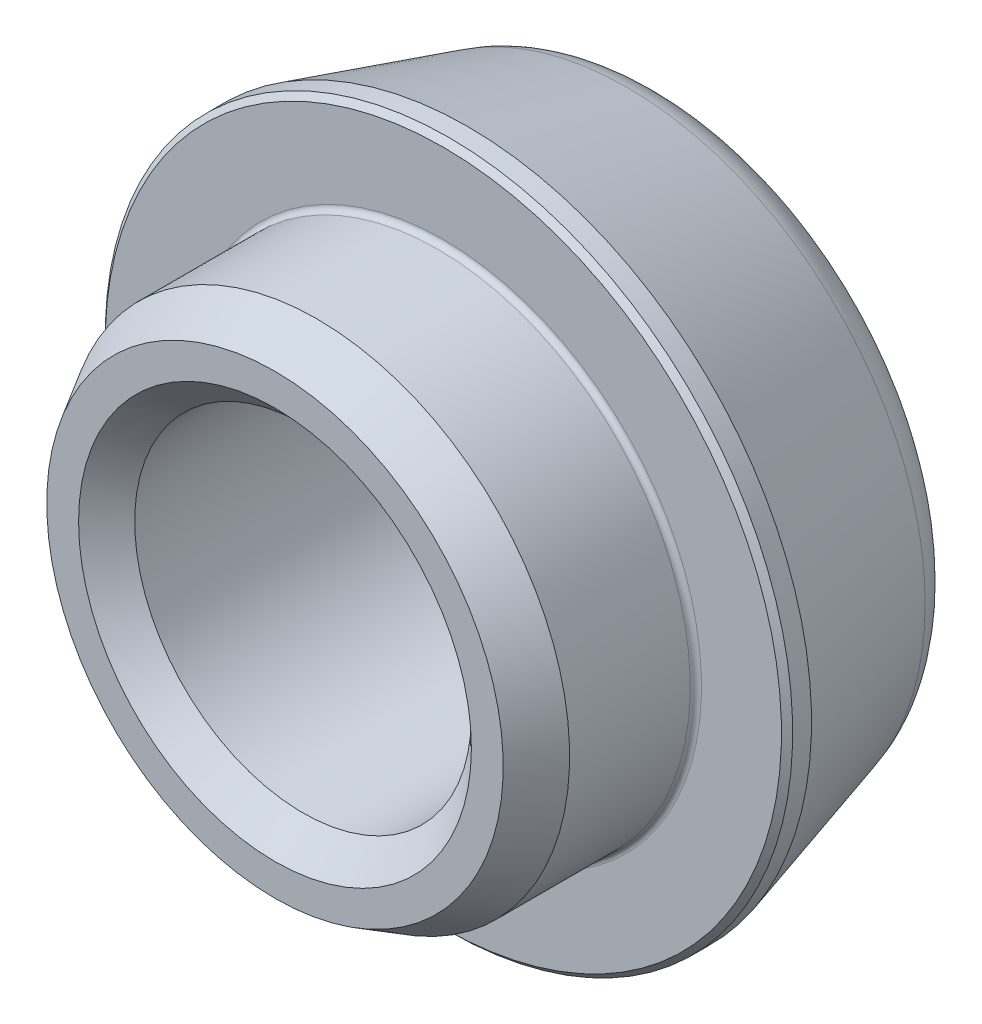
ISO-10303-21;
HEADER;
FILE_DESCRIPTION(('STEP AP214'),'2;1');
FILE_NAME('part.step','',(''),(''),'','','');
FILE_SCHEMA(('AUTOMOTIVE_DESIGN { 1 0 10303 214 1 1 1 1 }'));
ENDSEC;
DATA;
#1=APPLICATION_CONTEXT('core data for automotive mechanical design processes');
#2=APPLICATION_PROTOCOL_DEFINITION('international standard','automotive_design',2000,#1);
#3=PRODUCT_CONTEXT('',#1,'mechanical');
#4=PRODUCT('Part','Part','',(#3));
#5=PRODUCT_RELATED_PRODUCT_CATEGORY('part','',(#4));
#6=PRODUCT_DEFINITION_FORMATION('','',#4);
#7=PRODUCT_DEFINITION_CONTEXT('part definition',#1,'design');
#8=PRODUCT_DEFINITION('design','',#6,#7);
#9=PRODUCT_DEFINITION_SHAPE('','',#8);
#10=(LENGTH_UNIT() NAMED_UNIT(*) SI_UNIT(.MILLI.,.METRE.));
#11=(NAMED_UNIT(*) PLANE_ANGLE_UNIT() SI_UNIT($,.RADIAN.));
#12=(NAMED_UNIT(*) SI_UNIT($,.STERADIAN.) SOLID_ANGLE_UNIT());
#13=UNCERTAINTY_MEASURE_WITH_UNIT(LENGTH_MEASURE(1.E-05),#10,'distance_accuracy_value','');
#14=(GEOMETRIC_REPRESENTATION_CONTEXT(3) GLOBAL_UNCERTAINTY_ASSIGNED_CONTEXT((#13)) GLOBAL_UNIT_ASSIGNED_CONTEXT((#10,
#11,#12)) REPRESENTATION_CONTEXT('',''));
#15=CARTESIAN_POINT('',(0.,0.,0.));
#16=DIRECTION('',(0.,0.,1.));
#17=DIRECTION('',(1.,0.,0.));
#18=AXIS2_PLACEMENT_3D('',#15,#16,#17);
#19=CARTESIAN_POINT('',(0.,0.,0.));
#20=DIRECTION('',(0.,0.,-1.));
#21=DIRECTION('',(0.,1.,0.));
#22=AXIS2_PLACEMENT_3D('',#19,#20,#21);
#23=CYLINDRICAL_SURFACE('',#22,9.);
#24=CARTESIAN_POINT('',(0.,0.,0.2));
#25=DIRECTION('',(0.,0.,1.));
#26=DIRECTION('',(0.,-1.,0.));
#27=AXIS2_PLACEMENT_3D('',#24,#25,#26);
#28=CIRCLE('',#27,9.);
#29=CARTESIAN_POINT('',(0.,-9.,0.2));
#30=VERTEX_POINT('',#29);
#31=EDGE_CURVE('E32',#30,#30,#28,.T.);
#32=ORIENTED_EDGE('',*,*,#31,.T.);
#33=EDGE_LOOP('',(#32));
#34=FACE_BOUND('',#33,.T.);
#35=CARTESIAN_POINT('',(0.,0.,4.5));
#36=DIRECTION('',(0.,0.,1.));
#37=DIRECTION('',(0.,-1.,0.));
#38=AXIS2_PLACEMENT_3D('',#35,#36,#37);
#39=CIRCLE('',#38,9.);
#40=CARTESIAN_POINT('',(0.,-9.,4.5));
#41=VERTEX_POINT('',#40);
#42=EDGE_CURVE('E47',#41,#41,#39,.F.);
#43=ORIENTED_EDGE('',*,*,#42,.T.);
#44=EDGE_LOOP('',(#43));
#45=FACE_BOUND('',#44,.T.);
#46=ADVANCED_FACE('F12',(#34,#45),#23,.T.);
#47=CARTESIAN_POINT('',(9.,0.,0.));
#48=DIRECTION('',(0.,0.,1.));
#49=DIRECTION('',(0.,-1.,0.));
#50=AXIS2_PLACEMENT_3D('',#47,#48,#49);
#51=PLANE('',#50);
#52=CARTESIAN_POINT('',(0.,0.,0.));
#53=DIRECTION('',(0.,0.,1.));
#54=DIRECTION('',(0.,-1.,0.));
#55=AXIS2_PLACEMENT_3D('',#52,#53,#54);
#56=CIRCLE('',#55,9.2);
#57=CARTESIAN_POINT('',(0.,-9.2,0.));
#58=VERTEX_POINT('',#57);
#59=EDGE_CURVE('E35',#58,#58,#56,.F.);
#60=ORIENTED_EDGE('',*,*,#59,.T.);
#61=EDGE_LOOP('',(#60));
#62=FACE_BOUND('',#61,.T.);
#63=CARTESIAN_POINT('',(0.,0.,0.));
#64=DIRECTION('',(0.,0.,1.));
#65=DIRECTION('',(0.,-1.,0.));
#66=AXIS2_PLACEMENT_3D('',#63,#64,#65);
#67=CIRCLE('',#66,12.05);
#68=CARTESIAN_POINT('',(0.,-12.05,0.));
#69=VERTEX_POINT('',#68);
#70=EDGE_CURVE('E38',#69,#69,#67,.T.);
#71=ORIENTED_EDGE('',*,*,#70,.T.);
#72=EDGE_LOOP('',(#71));
#73=FACE_BOUND('',#72,.T.);
#74=ADVANCED_FACE('F64',(#62,#73),#51,.T.);
#75=CARTESIAN_POINT('',(0.,0.,0.));
#76=DIRECTION('',(0.,0.,-1.));
#77=DIRECTION('',(0.,1.,0.));
#78=AXIS2_PLACEMENT_3D('',#75,#76,#77);
#79=CYLINDRICAL_SURFACE('',#78,12.25);
#80=CARTESIAN_POINT('',(0.,0.,-0.2));
#81=DIRECTION('',(0.,0.,1.));
#82=DIRECTION('',(0.,-1.,0.));
#83=AXIS2_PLACEMENT_3D('',#80,#81,#82);
#84=CIRCLE('',#83,12.25);
#85=CARTESIAN_POINT('',(0.,-12.25,-0.2));
#86=VERTEX_POINT('',#85);
#87=EDGE_CURVE('E41',#86,#86,#84,.F.);
#88=ORIENTED_EDGE('',*,*,#87,.T.);
#89=EDGE_LOOP('',(#88));
#90=FACE_BOUND('',#89,.T.);
#91=CARTESIAN_POINT('',(0.,0.,-0.871853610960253));
#92=DIRECTION('',(0.,0.,-1.));
#93=DIRECTION('',(0.,1.,0.));
#94=AXIS2_PLACEMENT_3D('',#91,#92,#93);
#95=CIRCLE('',#94,12.25);
#96=CARTESIAN_POINT('',(0.,12.25,-0.871853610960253));
#97=VERTEX_POINT('',#96);
#98=EDGE_CURVE('E56',#97,#97,#95,.T.);
#99=ORIENTED_EDGE('',*,*,#98,.F.);
#100=EDGE_LOOP('',(#99));
#101=FACE_BOUND('',#100,.T.);
#102=ADVANCED_FACE('F62',(#90,#101),#79,.T.);
#103=CARTESIAN_POINT('',(0.,0.,-8.));
#104=DIRECTION('',(0.,0.,1.));
#105=DIRECTION('',(0.,-1.,0.));
#106=AXIS2_PLACEMENT_3D('',#103,#104,#105);
#107=CONICAL_SURFACE('',#106,10.2060369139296,0.279252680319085);
#108=CARTESIAN_POINT('',(0.,0.,-6.55127471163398));
#109=DIRECTION('',(0.,0.,-1.));
#110=DIRECTION('',(0.,1.,0.));
#111=AXIS2_PLACEMENT_3D('',#108,#109,#110);
#112=CIRCLE('',#111,10.6214522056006);
#113=CARTESIAN_POINT('',(0.,10.6214522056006,-6.55127471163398));
#114=VERTEX_POINT('',#113);
#115=EDGE_CURVE('E50',#114,#114,#112,.F.);
#116=ORIENTED_EDGE('',*,*,#115,.T.);
#117=EDGE_LOOP('',(#116));
#118=FACE_BOUND('',#117,.T.);
#119=ORIENTED_EDGE('',*,*,#98,.T.);
#120=EDGE_LOOP('',(#119));
#121=FACE_BOUND('',#120,.T.);
#122=ADVANCED_FACE('F60',(#118,#121),#107,.T.);
#123=CARTESIAN_POINT('',(0.,0.,-8.));
#124=DIRECTION('',(0.,0.,-1.));
#125=DIRECTION('',(0.,1.,0.));
#126=AXIS2_PLACEMENT_3D('',#123,#124,#125);
#127=PLANE('',#126);
#128=CARTESIAN_POINT('',(0.,0.,-8.));
#129=DIRECTION('',(0.,0.,-1.));
#130=DIRECTION('',(-1.,0.,0.));
#131=AXIS2_PLACEMENT_3D('',#128,#129,#130);
#132=CIRCLE('',#131,7.);
#133=CARTESIAN_POINT('',(-7.,0.,-8.));
#134=VERTEX_POINT('',#133);
#135=EDGE_CURVE('E8',#134,#134,#132,.F.);
#136=ORIENTED_EDGE('',*,*,#135,.T.);
#137=EDGE_LOOP('',(#136));
#138=FACE_BOUND('',#137,.T.);
#139=CARTESIAN_POINT('',(0.,0.,-8.));
#140=DIRECTION('',(0.,0.,-1.));
#141=DIRECTION('',(0.,1.,0.));
#142=AXIS2_PLACEMENT_3D('',#139,#140,#141);
#143=CIRCLE('',#142,8.69892881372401);
#144=CARTESIAN_POINT('',(0.,8.69892881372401,-8.));
#145=VERTEX_POINT('',#144);
#146=EDGE_CURVE('E53',#145,#145,#143,.T.);
#147=ORIENTED_EDGE('',*,*,#146,.T.);
#148=EDGE_LOOP('',(#147));
#149=FACE_BOUND('',#148,.T.);
#150=ADVANCED_FACE('F72',(#138,#149),#127,.T.);
#151=CARTESIAN_POINT('',(0.,0.,6.));
#152=DIRECTION('',(0.,0.,1.));
#153=DIRECTION('',(0.,-1.,0.));
#154=AXIS2_PLACEMENT_3D('',#151,#152,#153);
#155=PLANE('',#154);
#156=CARTESIAN_POINT('',(0.,0.,6.));
#157=DIRECTION('',(0.,0.,1.));
#158=DIRECTION('',(1.,0.,0.));
#159=AXIS2_PLACEMENT_3D('',#156,#157,#158);
#160=CIRCLE('',#159,7.);
#161=CARTESIAN_POINT('',(7.,0.,6.));
#162=VERTEX_POINT('',#161);
#163=EDGE_CURVE('E19',#162,#162,#160,.F.);
#164=ORIENTED_EDGE('',*,*,#163,.T.);
#165=EDGE_LOOP('',(#164));
#166=FACE_BOUND('',#165,.T.);
#167=CARTESIAN_POINT('',(0.,0.,6.));
#168=DIRECTION('',(0.,0.,1.));
#169=DIRECTION('',(0.,-1.,0.));
#170=AXIS2_PLACEMENT_3D('',#167,#168,#169);
#171=CIRCLE('',#170,8.13397459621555);
#172=CARTESIAN_POINT('',(0.,-8.13397459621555,6.));
#173=VERTEX_POINT('',#172);
#174=EDGE_CURVE('E44',#173,#173,#171,.T.);
#175=ORIENTED_EDGE('',*,*,#174,.T.);
#176=EDGE_LOOP('',(#175));
#177=FACE_BOUND('',#176,.T.);
#178=ADVANCED_FACE('F88',(#166,#177),#155,.T.);
#179=CARTESIAN_POINT('',(0.,0.,-6.));
#180=DIRECTION('',(0.,0.,-1.));
#181=DIRECTION('',(0.,1.,0.));
#182=AXIS2_PLACEMENT_3D('',#179,#180,#181);
#183=TOROIDAL_SURFACE('',#182,8.69892881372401,2.);
#184=ORIENTED_EDGE('',*,*,#115,.F.);
#185=EDGE_LOOP('',(#184));
#186=FACE_BOUND('',#185,.T.);
#187=ORIENTED_EDGE('',*,*,#146,.F.);
#188=EDGE_LOOP('',(#187));
#189=FACE_BOUND('',#188,.T.);
#190=ADVANCED_FACE('F84',(#186,#189),#183,.T.);
#191=CARTESIAN_POINT('',(0.,0.,4.5));
#192=DIRECTION('',(0.,0.,-1.));
#193=DIRECTION('',(0.,1.,0.));
#194=AXIS2_PLACEMENT_3D('',#191,#192,#193);
#195=CONICAL_SURFACE('',#194,9.,0.523598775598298);
#196=ORIENTED_EDGE('',*,*,#174,.F.);
#197=EDGE_LOOP('',(#196));
#198=FACE_BOUND('',#197,.T.);
#199=ORIENTED_EDGE('',*,*,#42,.F.);
#200=EDGE_LOOP('',(#199));
#201=FACE_BOUND('',#200,.T.);
#202=ADVANCED_FACE('F87',(#198,#201),#195,.T.);
#203=CARTESIAN_POINT('',(0.,0.,-0.2));
#204=DIRECTION('',(0.,0.,-1.));
#205=DIRECTION('',(0.,1.,0.));
#206=AXIS2_PLACEMENT_3D('',#203,#204,#205);
#207=CONICAL_SURFACE('',#206,12.25,0.785398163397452);
#208=ORIENTED_EDGE('',*,*,#70,.F.);
#209=EDGE_LOOP('',(#208));
#210=FACE_BOUND('',#209,.T.);
#211=ORIENTED_EDGE('',*,*,#87,.F.);
#212=EDGE_LOOP('',(#211));
#213=FACE_BOUND('',#212,.T.);
#214=ADVANCED_FACE('F92',(#210,#213),#207,.T.);
#215=CARTESIAN_POINT('',(0.,0.,0.2));
#216=DIRECTION('',(0.,0.,1.));
#217=DIRECTION('',(0.,-1.,0.));
#218=AXIS2_PLACEMENT_3D('',#215,#216,#217);
#219=TOROIDAL_SURFACE('',#218,9.2,0.2);
#220=ORIENTED_EDGE('',*,*,#31,.F.);
#221=EDGE_LOOP('',(#220));
#222=FACE_BOUND('',#221,.T.);
#223=ORIENTED_EDGE('',*,*,#59,.F.);
#224=EDGE_LOOP('',(#223));
#225=FACE_BOUND('',#224,.T.);
#226=ADVANCED_FACE('F96',(#222,#225),#219,.F.);
#227=CARTESIAN_POINT('',(0.,0.,-8.));
#228=DIRECTION('',(0.,0.,1.));
#229=DIRECTION('',(1.,0.,0.));
#230=AXIS2_PLACEMENT_3D('',#227,#228,#229);
#231=CYLINDRICAL_SURFACE('',#230,6.);
#232=CARTESIAN_POINT('',(0.,0.,5.));
#233=DIRECTION('',(0.,0.,1.));
#234=DIRECTION('',(1.,0.,0.));
#235=AXIS2_PLACEMENT_3D('',#232,#233,#234);
#236=CIRCLE('',#235,6.);
#237=CARTESIAN_POINT('',(6.,0.,5.));
#238=VERTEX_POINT('',#237);
#239=EDGE_CURVE('E23',#238,#238,#236,.T.);
#240=ORIENTED_EDGE('',*,*,#239,.T.);
#241=EDGE_LOOP('',(#240));
#242=FACE_BOUND('',#241,.T.);
#243=CARTESIAN_POINT('',(0.,0.,-7.));
#244=DIRECTION('',(0.,0.,-1.));
#245=DIRECTION('',(-1.,0.,0.));
#246=AXIS2_PLACEMENT_3D('',#243,#244,#245);
#247=CIRCLE('',#246,6.);
#248=CARTESIAN_POINT('',(-6.,0.,-7.));
#249=VERTEX_POINT('',#248);
#250=EDGE_CURVE('E27',#249,#249,#247,.T.);
#251=ORIENTED_EDGE('',*,*,#250,.T.);
#252=EDGE_LOOP('',(#251));
#253=FACE_BOUND('',#252,.T.);
#254=ADVANCED_FACE('F99',(#242,#253),#231,.F.);
#255=CARTESIAN_POINT('',(0.,0.,5.));
#256=DIRECTION('',(0.,0.,1.));
#257=DIRECTION('',(1.,0.,0.));
#258=AXIS2_PLACEMENT_3D('',#255,#256,#257);
#259=CONICAL_SURFACE('',#258,6.,0.785398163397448);
#260=ORIENTED_EDGE('',*,*,#163,.F.);
#261=EDGE_LOOP('',(#260));
#262=FACE_BOUND('',#261,.T.);
#263=ORIENTED_EDGE('',*,*,#239,.F.);
#264=EDGE_LOOP('',(#263));
#265=FACE_BOUND('',#264,.T.);
#266=ADVANCED_FACE('F101',(#262,#265),#259,.F.);
#267=CARTESIAN_POINT('',(0.,0.,-8.));
#268=DIRECTION('',(0.,0.,-1.));
#269=DIRECTION('',(-1.,0.,0.));
#270=AXIS2_PLACEMENT_3D('',#267,#268,#269);
#271=CONICAL_SURFACE('',#270,7.,0.785398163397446);
#272=ORIENTED_EDGE('',*,*,#250,.F.);
#273=EDGE_LOOP('',(#272));
#274=FACE_BOUND('',#273,.T.);
#275=ORIENTED_EDGE('',*,*,#135,.F.);
#276=EDGE_LOOP('',(#275));
#277=FACE_BOUND('',#276,.T.);
#278=ADVANCED_FACE('F14',(#274,#277),#271,.F.);
#279=CLOSED_SHELL('',(#46,#74,#102,#122,#150,#178,#190,#202,#214,#226,#254,#266,#278));
#280=MANIFOLD_SOLID_BREP('B1',#279);
#281=ADVANCED_BREP_SHAPE_REPRESENTATION('',(#18,#280),#14);
#282=SHAPE_DEFINITION_REPRESENTATION(#9,#281);
ENDSEC;
END-ISO-10303-21;
